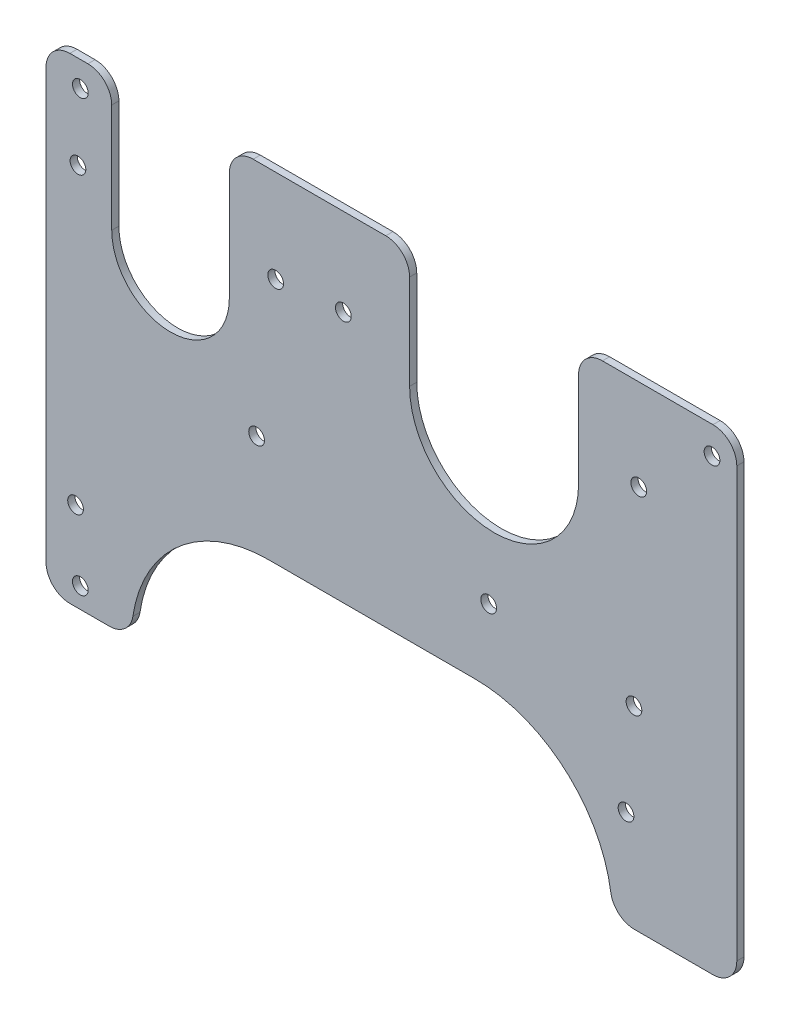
from build123d import *

# Parameters (mm, degrees)
SKICA1_W                 = 145
SKICA1_H                 = 100
P_IDAT_VYSUNUT_M1_DEPTH  = 1.5
SKICA2_R                 = 1.65
ODEBRAT_VYSUNUT_M1_DEPTH = 1.5
SKICA3_R                 = 1.65
ODEBRAT_VYSUNUT_M2_DEPTH = 137.591595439
ODEBRAT_VYSUNUT_M3_DEPTH = 137.591595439
ZAOBLIT2_R               = 5


with BuildPart() as part:
    # Skica1 → P_idat vysunut_m1 (new body)
    with BuildSketch(Plane.XY):
        with Locations((41.916780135, 24.590980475)):
            Rectangle(SKICA1_W, SKICA1_H)
    extrude(amount=P_IDAT_VYSUNUT_M1_DEPTH)

    # Skica2 → Odebrat vysunut_m1 (cut)
    with BuildSketch(Plane(origin=(0, 0, 0), x_dir=(-1, 0, 0), z_dir=(0, 0, -1))):
        with Locations((23.388650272, -21.109019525)):
            Circle(SKICA2_R)
        with Locations((23.388650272, 69.290980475)):
            Circle(SKICA2_R)
        with Locations((-91.161349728, -4.959019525)):
            Circle(SKICA2_R)
        with Locations((-109.211349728, 68.790980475)):
            Circle(SKICA2_R)
    extrude(amount=-ODEBRAT_VYSUNUT_M1_DEPTH, mode=Mode.SUBTRACT)

    # Skica3 → Odebrat vysunut_m2 (cut, through all)
    with BuildSketch(Plane(origin=(0, 0, 0), x_dir=(-1, 0, 0), z_dir=(0, 0, -1))):
        with Locations((-17.614403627, 55.116871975)):
            Circle(SKICA3_R)
        with Locations((-13.614403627, 24.616871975)):
            Circle(SKICA3_R)
        with Locations((23.885596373, 55.116871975)):
            Circle(SKICA3_R)
        with Locations((24.385596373, -6.883128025)):
            Circle(SKICA3_R)
        with Locations((-31.829272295, 56.267954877)):
            Circle(SKICA3_R)
        with Locations((-62.329272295, 18.467954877)):
            Circle(SKICA3_R)
        with Locations((-93.829272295, 55.467954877)):
            Circle(SKICA3_R)
        with Locations((-92.829272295, 15.167954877)):
            Circle(SKICA3_R)
    extrude(amount=-ODEBRAT_VYSUNUT_M2_DEPTH, mode=Mode.SUBTRACT)

    # Skica4 → Odebrat vysunut_m3 (cut, through all)
    with BuildSketch(Plane.XY.offset(1.5)):
        with BuildLine():
            Line((-16.791739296, 46.827764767), (-16.791739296, 74.590980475))
            ThreePointArc((-16.791739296, 74.590980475), (-4.450000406, 86.932719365), (7.891738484, 74.590980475))
            Line((7.891738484, 74.590980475), (7.891738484, 46.827764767))
            ThreePointArc((7.891738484, 46.827764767), (-4.450000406, 34.486025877), (-16.791739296, 46.827764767))
        make_face()
        with BuildLine():
            Line((45.733057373, 49.719850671), (45.733057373, 74.590980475))
            ThreePointArc((45.733057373, 74.590980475), (63.469192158, 92.327115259), (81.205326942, 74.590980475))
            Line((81.205326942, 74.590980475), (81.205326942, 49.719850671))
            ThreePointArc((81.205326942, 49.719850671), (63.469192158, 31.983715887), (45.733057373, 49.719850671))
        make_face()
        with BuildLine():
            Line((16.128994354, 3.397083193), (59.4782687, 3.397083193))
            ThreePointArc((59.4782687, 3.397083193), (88.284371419, -25.409019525), (59.4782687, -54.215122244))
            Line((59.4782687, -54.215122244), (16.128994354, -54.215122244))
            ThreePointArc((16.128994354, -54.215122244), (-12.677108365, -25.409019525), (16.128994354, 3.397083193))
        make_face()
    extrude(amount=-ODEBRAT_VYSUNUT_M3_DEPTH, mode=Mode.SUBTRACT)

    # Zaoblit2
    zaoblit2_edges = [part.edges().sort_by_distance(p)[0] for p in [
        (-12.677108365, -25.409019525, 0.75),
        (88.284371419, -25.409019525, 0.75),
        (-30.583219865, 74.590980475, 0.75),
        (114.416780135, 74.590980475, 0.75),
        (114.416780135, -25.409019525, 0.75),
        (-30.583219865, -25.409019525, 0.75),
        (-16.791739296, 74.590980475, 0.75),
        (7.891738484, 74.590980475, 0.75),
        (45.733057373, 74.590980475, 0.75),
        (81.205326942, 74.590980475, 0.75),
    ]]
    fillet(zaoblit2_edges, radius=ZAOBLIT2_R)


solid = part.part
